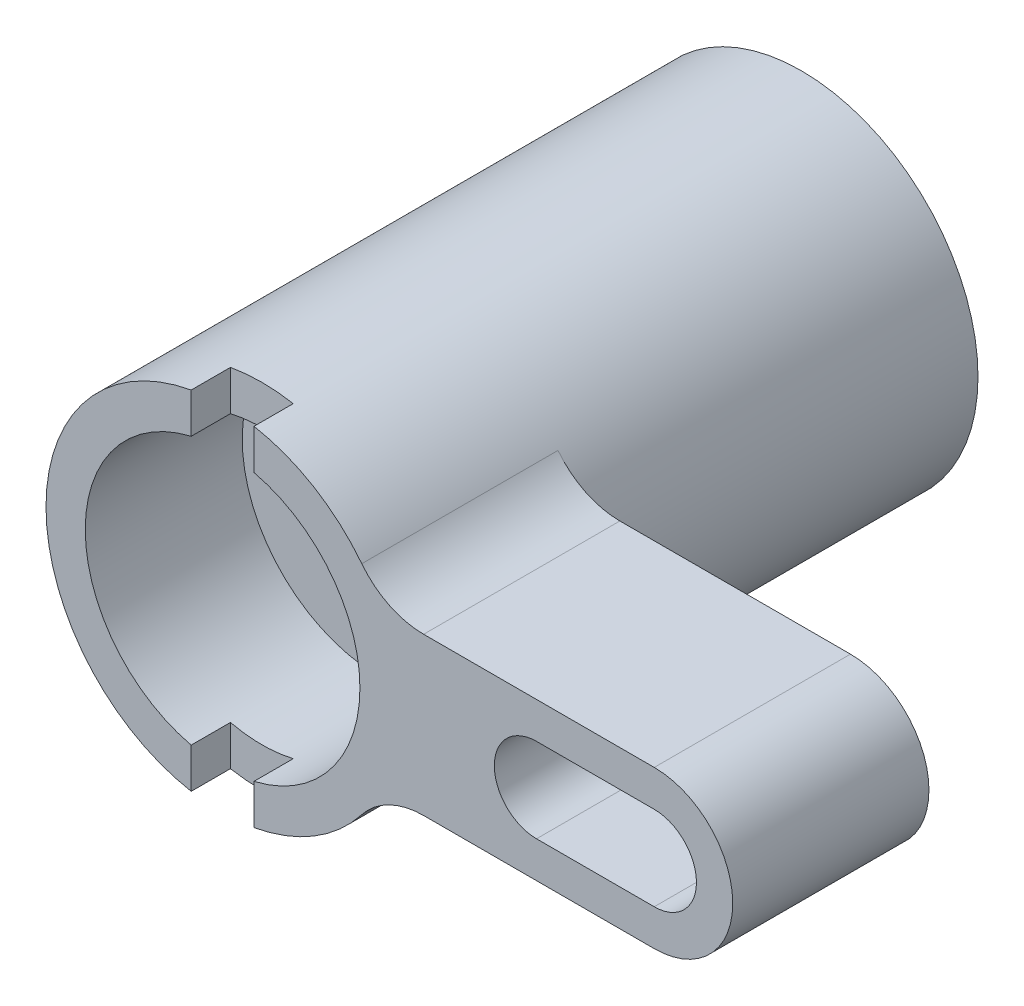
ISO-10303-21;
HEADER;
FILE_DESCRIPTION(('STEP AP214'),'2;1');
FILE_NAME('part.step','',(''),(''),'','','');
FILE_SCHEMA(('AUTOMOTIVE_DESIGN { 1 0 10303 214 1 1 1 1 }'));
ENDSEC;
DATA;
#1=APPLICATION_CONTEXT('core data for automotive mechanical design processes');
#2=APPLICATION_PROTOCOL_DEFINITION('international standard','automotive_design',2000,#1);
#3=PRODUCT_CONTEXT('',#1,'mechanical');
#4=PRODUCT('Part','Part','',(#3));
#5=PRODUCT_RELATED_PRODUCT_CATEGORY('part','',(#4));
#6=PRODUCT_DEFINITION_FORMATION('','',#4);
#7=PRODUCT_DEFINITION_CONTEXT('part definition',#1,'design');
#8=PRODUCT_DEFINITION('design','',#6,#7);
#9=PRODUCT_DEFINITION_SHAPE('','',#8);
#10=(LENGTH_UNIT() NAMED_UNIT(*) SI_UNIT(.MILLI.,.METRE.));
#11=(NAMED_UNIT(*) PLANE_ANGLE_UNIT() SI_UNIT($,.RADIAN.));
#12=(NAMED_UNIT(*) SI_UNIT($,.STERADIAN.) SOLID_ANGLE_UNIT());
#13=UNCERTAINTY_MEASURE_WITH_UNIT(LENGTH_MEASURE(1.E-05),#10,'distance_accuracy_value','');
#14=(GEOMETRIC_REPRESENTATION_CONTEXT(3) GLOBAL_UNCERTAINTY_ASSIGNED_CONTEXT((#13)) GLOBAL_UNIT_ASSIGNED_CONTEXT((#10,
#11,#12)) REPRESENTATION_CONTEXT('',''));
#15=CARTESIAN_POINT('',(0.,0.,0.));
#16=DIRECTION('',(0.,0.,1.));
#17=DIRECTION('',(1.,0.,0.));
#18=AXIS2_PLACEMENT_3D('',#15,#16,#17);
#19=CARTESIAN_POINT('',(0.,0.,29.5));
#20=DIRECTION('',(0.,0.,1.));
#21=DIRECTION('',(0.,1.,0.));
#22=AXIS2_PLACEMENT_3D('',#19,#20,#21);
#23=PLANE('',#22);
#24=CARTESIAN_POINT('',(22.,0.,29.5));
#25=DIRECTION('',(0.,0.,1.));
#26=DIRECTION('',(0.,1.,0.));
#27=AXIS2_PLACEMENT_3D('',#24,#25,#26);
#28=CIRCLE('',#27,2.15);
#29=CARTESIAN_POINT('',(22.,-2.15,29.5));
#30=VERTEX_POINT('',#29);
#31=CARTESIAN_POINT('',(22.,2.15,29.5));
#32=VERTEX_POINT('',#31);
#33=EDGE_CURVE('E176',#30,#32,#28,.T.);
#34=ORIENTED_EDGE('',*,*,#33,.F.);
#35=DIRECTION('',(1.,0.,0.));
#36=VECTOR('',#35,1.);
#37=CARTESIAN_POINT('',(22.,-2.15,29.5));
#38=LINE('',#37,#36);
#39=CARTESIAN_POINT('',(16.,-2.15,29.5));
#40=VERTEX_POINT('',#39);
#41=EDGE_CURVE('E184',#40,#30,#38,.T.);
#42=ORIENTED_EDGE('',*,*,#41,.F.);
#43=CARTESIAN_POINT('',(16.,0.,29.5));
#44=DIRECTION('',(0.,0.,1.));
#45=DIRECTION('',(0.,1.,0.));
#46=AXIS2_PLACEMENT_3D('',#43,#44,#45);
#47=CIRCLE('',#46,2.15);
#48=CARTESIAN_POINT('',(16.,2.15,29.5));
#49=VERTEX_POINT('',#48);
#50=EDGE_CURVE('E181',#49,#40,#47,.T.);
#51=ORIENTED_EDGE('',*,*,#50,.F.);
#52=DIRECTION('',(-1.,0.,0.));
#53=VECTOR('',#52,1.);
#54=CARTESIAN_POINT('',(22.,2.15,29.5));
#55=LINE('',#54,#53);
#56=EDGE_CURVE('E178',#32,#49,#55,.T.);
#57=ORIENTED_EDGE('',*,*,#56,.F.);
#58=EDGE_LOOP('',(#34,#42,#51,#57));
#59=FACE_BOUND('',#58,.T.);
#60=DIRECTION('',(0.,1.,0.));
#61=VECTOR('',#60,1.);
#62=CARTESIAN_POINT('',(1.6,-9.5,29.5));
#63=LINE('',#62,#61);
#64=CARTESIAN_POINT('',(1.6,6.81469001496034,29.5));
#65=VERTEX_POINT('',#64);
#66=CARTESIAN_POINT('',(1.6,8.85663593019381,29.5));
#67=VERTEX_POINT('',#66);
#68=EDGE_CURVE('E245',#65,#67,#63,.T.);
#69=ORIENTED_EDGE('',*,*,#68,.F.);
#70=CARTESIAN_POINT('',(0.,0.,29.5));
#71=DIRECTION('',(0.,0.,1.));
#72=DIRECTION('',(0.,1.,0.));
#73=AXIS2_PLACEMENT_3D('',#70,#71,#72);
#74=CIRCLE('',#73,7.);
#75=CARTESIAN_POINT('',(1.6,-6.81469001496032,29.5));
#76=VERTEX_POINT('',#75);
#77=EDGE_CURVE('E260',#65,#76,#74,.F.);
#78=ORIENTED_EDGE('',*,*,#77,.T.);
#79=CARTESIAN_POINT('',(1.6,-8.85663593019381,29.5));
#80=VERTEX_POINT('',#79);
#81=EDGE_CURVE('E152',#80,#76,#63,.T.);
#82=ORIENTED_EDGE('',*,*,#81,.F.);
#83=CARTESIAN_POINT('',(0.,0.,29.5));
#84=DIRECTION('',(0.,0.,1.));
#85=DIRECTION('',(0.,1.,0.));
#86=AXIS2_PLACEMENT_3D('',#83,#84,#85);
#87=CIRCLE('',#86,9.);
#88=CARTESIAN_POINT('',(7.09404283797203,-5.53846153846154,29.5));
#89=VERTEX_POINT('',#88);
#90=EDGE_CURVE('E320',#80,#89,#87,.T.);
#91=ORIENTED_EDGE('',*,*,#90,.T.);
#92=CARTESIAN_POINT('',(10.2469507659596,-8.,29.5));
#93=DIRECTION('',(0.,0.,1.));
#94=DIRECTION('',(0.,1.,0.));
#95=AXIS2_PLACEMENT_3D('',#92,#93,#94);
#96=CIRCLE('',#95,4.);
#97=CARTESIAN_POINT('',(10.2469507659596,-4.,29.5));
#98=VERTEX_POINT('',#97);
#99=EDGE_CURVE('E235',#89,#98,#96,.F.);
#100=ORIENTED_EDGE('',*,*,#99,.T.);
#101=DIRECTION('',(1.,0.,0.));
#102=VECTOR('',#101,1.);
#103=CARTESIAN_POINT('',(22.,-4.,29.5));
#104=LINE('',#103,#102);
#105=CARTESIAN_POINT('',(22.,-4.,29.5));
#106=VERTEX_POINT('',#105);
#107=EDGE_CURVE('E317',#98,#106,#104,.T.);
#108=ORIENTED_EDGE('',*,*,#107,.T.);
#109=CARTESIAN_POINT('',(22.,0.,29.5));
#110=DIRECTION('',(0.,0.,1.));
#111=DIRECTION('',(0.,1.,0.));
#112=AXIS2_PLACEMENT_3D('',#109,#110,#111);
#113=CIRCLE('',#112,4.);
#114=CARTESIAN_POINT('',(22.,4.,29.5));
#115=VERTEX_POINT('',#114);
#116=EDGE_CURVE('E220',#106,#115,#113,.T.);
#117=ORIENTED_EDGE('',*,*,#116,.T.);
#118=DIRECTION('',(-1.,0.,0.));
#119=VECTOR('',#118,1.);
#120=CARTESIAN_POINT('',(22.,4.,29.5));
#121=LINE('',#120,#119);
#122=CARTESIAN_POINT('',(10.2469507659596,4.,29.5));
#123=VERTEX_POINT('',#122);
#124=EDGE_CURVE('E341',#115,#123,#121,.T.);
#125=ORIENTED_EDGE('',*,*,#124,.T.);
#126=CARTESIAN_POINT('',(10.2469507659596,8.,29.5));
#127=DIRECTION('',(0.,0.,1.));
#128=DIRECTION('',(0.,1.,0.));
#129=AXIS2_PLACEMENT_3D('',#126,#127,#128);
#130=CIRCLE('',#129,4.);
#131=CARTESIAN_POINT('',(7.09404283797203,5.53846153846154,29.5));
#132=VERTEX_POINT('',#131);
#133=EDGE_CURVE('E22',#123,#132,#130,.F.);
#134=ORIENTED_EDGE('',*,*,#133,.T.);
#135=EDGE_CURVE('E312',#132,#67,#87,.T.);
#136=ORIENTED_EDGE('',*,*,#135,.T.);
#137=EDGE_LOOP('',(#69,#78,#82,#91,#100,#108,#117,#125,#134,#136));
#138=FACE_BOUND('',#137,.T.);
#139=ADVANCED_FACE('F14',(#59,#138),#23,.T.);
#140=DIRECTION('',(0.,-1.,0.));
#141=VECTOR('',#140,1.);
#142=CARTESIAN_POINT('',(-1.6,-9.5,29.5));
#143=LINE('',#142,#141);
#144=CARTESIAN_POINT('',(-1.6,-6.81469001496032,29.5));
#145=VERTEX_POINT('',#144);
#146=CARTESIAN_POINT('',(-1.6,-8.85663593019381,29.5));
#147=VERTEX_POINT('',#146);
#148=EDGE_CURVE('E165',#145,#147,#143,.T.);
#149=ORIENTED_EDGE('',*,*,#148,.F.);
#150=CARTESIAN_POINT('',(0.,0.,29.5));
#151=DIRECTION('',(0.,0.,1.));
#152=DIRECTION('',(0.,1.,0.));
#153=AXIS2_PLACEMENT_3D('',#150,#151,#152);
#154=CIRCLE('',#153,7.);
#155=CARTESIAN_POINT('',(-1.6,6.81469001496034,29.5));
#156=VERTEX_POINT('',#155);
#157=EDGE_CURVE('E153',#145,#156,#154,.F.);
#158=ORIENTED_EDGE('',*,*,#157,.T.);
#159=CARTESIAN_POINT('',(-1.6,8.85663593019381,29.5));
#160=VERTEX_POINT('',#159);
#161=EDGE_CURVE('E163',#160,#156,#143,.T.);
#162=ORIENTED_EDGE('',*,*,#161,.F.);
#163=EDGE_CURVE('E318',#160,#147,#87,.T.);
#164=ORIENTED_EDGE('',*,*,#163,.T.);
#165=EDGE_LOOP('',(#149,#158,#162,#164));
#166=FACE_BOUND('',#165,.T.);
#167=ADVANCED_FACE('F299',(#166),#23,.T.);
#168=CARTESIAN_POINT('',(1.6,9.5,27.5));
#169=DIRECTION('',(0.,0.,1.));
#170=DIRECTION('',(0.,1.,0.));
#171=AXIS2_PLACEMENT_3D('',#168,#169,#170);
#172=PLANE('',#171);
#173=DIRECTION('',(0.,-1.,0.));
#174=VECTOR('',#173,1.);
#175=CARTESIAN_POINT('',(-1.6,-9.5,27.5));
#176=LINE('',#175,#174);
#177=CARTESIAN_POINT('',(-1.6,8.85663593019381,27.5));
#178=VERTEX_POINT('',#177);
#179=CARTESIAN_POINT('',(-1.6,6.81469001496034,27.5));
#180=VERTEX_POINT('',#179);
#181=EDGE_CURVE('E161',#178,#180,#176,.T.);
#182=ORIENTED_EDGE('',*,*,#181,.T.);
#183=CARTESIAN_POINT('',(0.,0.,27.5));
#184=DIRECTION('',(0.,0.,1.));
#185=DIRECTION('',(0.,1.,0.));
#186=AXIS2_PLACEMENT_3D('',#183,#184,#185);
#187=CIRCLE('',#186,7.);
#188=CARTESIAN_POINT('',(1.6,6.81469001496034,27.5));
#189=VERTEX_POINT('',#188);
#190=EDGE_CURVE('E243',#180,#189,#187,.F.);
#191=ORIENTED_EDGE('',*,*,#190,.T.);
#192=DIRECTION('',(0.,1.,0.));
#193=VECTOR('',#192,1.);
#194=CARTESIAN_POINT('',(1.6,-9.5,27.5));
#195=LINE('',#194,#193);
#196=CARTESIAN_POINT('',(1.6,8.85663593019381,27.5));
#197=VERTEX_POINT('',#196);
#198=EDGE_CURVE('E159',#189,#197,#195,.T.);
#199=ORIENTED_EDGE('',*,*,#198,.T.);
#200=CARTESIAN_POINT('',(0.,0.,27.5));
#201=DIRECTION('',(0.,0.,1.));
#202=DIRECTION('',(0.,1.,0.));
#203=AXIS2_PLACEMENT_3D('',#200,#201,#202);
#204=CIRCLE('',#203,9.);
#205=EDGE_CURVE('E326',#197,#178,#204,.T.);
#206=ORIENTED_EDGE('',*,*,#205,.T.);
#207=EDGE_LOOP('',(#182,#191,#199,#206));
#208=FACE_BOUND('',#207,.T.);
#209=ADVANCED_FACE('F305',(#208),#172,.T.);
#210=CARTESIAN_POINT('',(-1.6,-9.5,27.5));
#211=DIRECTION('',(-1.,0.,0.));
#212=DIRECTION('',(0.,-1.,0.));
#213=AXIS2_PLACEMENT_3D('',#210,#211,#212);
#214=PLANE('',#213);
#215=DIRECTION('',(0.,0.,-1.));
#216=VECTOR('',#215,1.);
#217=CARTESIAN_POINT('',(-1.6,6.81469001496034,31.5));
#218=LINE('',#217,#216);
#219=EDGE_CURVE('E256',#180,#156,#218,.F.);
#220=ORIENTED_EDGE('',*,*,#219,.F.);
#221=ORIENTED_EDGE('',*,*,#181,.F.);
#222=DIRECTION('',(0.,0.,-1.));
#223=VECTOR('',#222,1.);
#224=CARTESIAN_POINT('',(-1.6,8.85663593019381,29.5));
#225=LINE('',#224,#223);
#226=EDGE_CURVE('E328',#160,#178,#225,.T.);
#227=ORIENTED_EDGE('',*,*,#226,.F.);
#228=ORIENTED_EDGE('',*,*,#161,.T.);
#229=EDGE_LOOP('',(#220,#221,#227,#228));
#230=FACE_BOUND('',#229,.T.);
#231=ADVANCED_FACE('F378',(#230),#214,.F.);
#232=CARTESIAN_POINT('',(1.6,-9.5,27.5));
#233=DIRECTION('',(1.,0.,0.));
#234=DIRECTION('',(0.,1.,0.));
#235=AXIS2_PLACEMENT_3D('',#232,#233,#234);
#236=PLANE('',#235);
#237=DIRECTION('',(0.,0.,-1.));
#238=VECTOR('',#237,1.);
#239=CARTESIAN_POINT('',(1.6,6.81469001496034,31.5));
#240=LINE('',#239,#238);
#241=EDGE_CURVE('E258',#65,#189,#240,.T.);
#242=ORIENTED_EDGE('',*,*,#241,.F.);
#243=ORIENTED_EDGE('',*,*,#68,.T.);
#244=DIRECTION('',(0.,0.,-1.));
#245=VECTOR('',#244,1.);
#246=CARTESIAN_POINT('',(1.6,8.85663593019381,29.5));
#247=LINE('',#246,#245);
#248=EDGE_CURVE('E322',#197,#67,#247,.F.);
#249=ORIENTED_EDGE('',*,*,#248,.F.);
#250=ORIENTED_EDGE('',*,*,#198,.F.);
#251=EDGE_LOOP('',(#242,#243,#249,#250));
#252=FACE_BOUND('',#251,.T.);
#253=ADVANCED_FACE('F382',(#252),#236,.F.);
#254=DIRECTION('',(0.,0.,-1.));
#255=VECTOR('',#254,1.);
#256=CARTESIAN_POINT('',(1.6,-6.81469001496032,31.5));
#257=LINE('',#256,#255);
#258=CARTESIAN_POINT('',(1.6,-6.81469001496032,27.5));
#259=VERTEX_POINT('',#258);
#260=EDGE_CURVE('E140',#259,#76,#257,.F.);
#261=ORIENTED_EDGE('',*,*,#260,.F.);
#262=CARTESIAN_POINT('',(1.6,-8.85663593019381,27.5));
#263=VERTEX_POINT('',#262);
#264=EDGE_CURVE('E149',#263,#259,#195,.T.);
#265=ORIENTED_EDGE('',*,*,#264,.F.);
#266=DIRECTION('',(0.,0.,-1.));
#267=VECTOR('',#266,1.);
#268=CARTESIAN_POINT('',(1.6,-8.85663593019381,29.5));
#269=LINE('',#268,#267);
#270=EDGE_CURVE('E221',#80,#263,#269,.T.);
#271=ORIENTED_EDGE('',*,*,#270,.F.);
#272=ORIENTED_EDGE('',*,*,#81,.T.);
#273=EDGE_LOOP('',(#261,#265,#271,#272));
#274=FACE_BOUND('',#273,.T.);
#275=ADVANCED_FACE('F148',(#274),#236,.F.);
#276=DIRECTION('',(0.,0.,-1.));
#277=VECTOR('',#276,1.);
#278=CARTESIAN_POINT('',(-1.6,-6.81469001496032,31.5));
#279=LINE('',#278,#277);
#280=CARTESIAN_POINT('',(-1.6,-6.81469001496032,27.5));
#281=VERTEX_POINT('',#280);
#282=EDGE_CURVE('E30',#145,#281,#279,.T.);
#283=ORIENTED_EDGE('',*,*,#282,.F.);
#284=ORIENTED_EDGE('',*,*,#148,.T.);
#285=DIRECTION('',(0.,0.,-1.));
#286=VECTOR('',#285,1.);
#287=CARTESIAN_POINT('',(-1.6,-8.85663593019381,29.5));
#288=LINE('',#287,#286);
#289=CARTESIAN_POINT('',(-1.6,-8.85663593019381,27.5));
#290=VERTEX_POINT('',#289);
#291=EDGE_CURVE('E330',#290,#147,#288,.F.);
#292=ORIENTED_EDGE('',*,*,#291,.F.);
#293=EDGE_CURVE('E158',#281,#290,#176,.T.);
#294=ORIENTED_EDGE('',*,*,#293,.F.);
#295=EDGE_LOOP('',(#283,#284,#292,#294));
#296=FACE_BOUND('',#295,.T.);
#297=ADVANCED_FACE('F384',(#296),#214,.F.);
#298=ORIENTED_EDGE('',*,*,#264,.T.);
#299=CARTESIAN_POINT('',(0.,0.,27.5));
#300=DIRECTION('',(0.,0.,1.));
#301=DIRECTION('',(0.,1.,0.));
#302=AXIS2_PLACEMENT_3D('',#299,#300,#301);
#303=CIRCLE('',#302,7.);
#304=EDGE_CURVE('E9',#259,#281,#303,.F.);
#305=ORIENTED_EDGE('',*,*,#304,.T.);
#306=ORIENTED_EDGE('',*,*,#293,.T.);
#307=EDGE_CURVE('E157',#290,#263,#204,.T.);
#308=ORIENTED_EDGE('',*,*,#307,.T.);
#309=EDGE_LOOP('',(#298,#305,#306,#308));
#310=FACE_BOUND('',#309,.T.);
#311=ADVANCED_FACE('F155',(#310),#172,.T.);
#312=CARTESIAN_POINT('',(0.,0.,19.5));
#313=DIRECTION('',(0.,0.,1.));
#314=DIRECTION('',(0.,1.,0.));
#315=AXIS2_PLACEMENT_3D('',#312,#313,#314);
#316=PLANE('',#315);
#317=DIRECTION('',(-1.,0.,0.));
#318=VECTOR('',#317,1.);
#319=CARTESIAN_POINT('',(22.,-2.15,19.5));
#320=LINE('',#319,#318);
#321=CARTESIAN_POINT('',(22.,-2.15,19.5));
#322=VERTEX_POINT('',#321);
#323=CARTESIAN_POINT('',(16.,-2.15,19.5));
#324=VERTEX_POINT('',#323);
#325=EDGE_CURVE('E170',#322,#324,#320,.T.);
#326=ORIENTED_EDGE('',*,*,#325,.F.);
#327=CARTESIAN_POINT('',(22.,0.,19.5));
#328=DIRECTION('',(0.,0.,1.));
#329=DIRECTION('',(0.,1.,0.));
#330=AXIS2_PLACEMENT_3D('',#327,#328,#329);
#331=CIRCLE('',#330,2.15);
#332=CARTESIAN_POINT('',(22.,2.15,19.5));
#333=VERTEX_POINT('',#332);
#334=EDGE_CURVE('E173',#333,#322,#331,.F.);
#335=ORIENTED_EDGE('',*,*,#334,.F.);
#336=DIRECTION('',(1.,0.,0.));
#337=VECTOR('',#336,1.);
#338=CARTESIAN_POINT('',(22.,2.15,19.5));
#339=LINE('',#338,#337);
#340=CARTESIAN_POINT('',(16.,2.15,19.5));
#341=VERTEX_POINT('',#340);
#342=EDGE_CURVE('E190',#341,#333,#339,.T.);
#343=ORIENTED_EDGE('',*,*,#342,.F.);
#344=CARTESIAN_POINT('',(16.,0.,19.5));
#345=DIRECTION('',(0.,0.,1.));
#346=DIRECTION('',(0.,1.,0.));
#347=AXIS2_PLACEMENT_3D('',#344,#345,#346);
#348=CIRCLE('',#347,2.15);
#349=EDGE_CURVE('E168',#324,#341,#348,.F.);
#350=ORIENTED_EDGE('',*,*,#349,.F.);
#351=EDGE_LOOP('',(#326,#335,#343,#350));
#352=FACE_BOUND('',#351,.T.);
#353=DIRECTION('',(1.,0.,0.));
#354=VECTOR('',#353,1.);
#355=CARTESIAN_POINT('',(22.,-4.,19.5));
#356=LINE('',#355,#354);
#357=CARTESIAN_POINT('',(10.2469507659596,-4.,19.5));
#358=VERTEX_POINT('',#357);
#359=CARTESIAN_POINT('',(22.,-4.,19.5));
#360=VERTEX_POINT('',#359);
#361=EDGE_CURVE('E217',#358,#360,#356,.T.);
#362=ORIENTED_EDGE('',*,*,#361,.F.);
#363=CARTESIAN_POINT('',(10.2469507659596,-8.,19.5));
#364=DIRECTION('',(0.,0.,1.));
#365=DIRECTION('',(0.,1.,0.));
#366=AXIS2_PLACEMENT_3D('',#363,#364,#365);
#367=CIRCLE('',#366,4.);
#368=CARTESIAN_POINT('',(7.09404283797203,-5.53846153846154,19.5));
#369=VERTEX_POINT('',#368);
#370=EDGE_CURVE('E232',#358,#369,#367,.T.);
#371=ORIENTED_EDGE('',*,*,#370,.T.);
#372=CARTESIAN_POINT('',(0.,0.,19.5));
#373=DIRECTION('',(0.,0.,1.));
#374=DIRECTION('',(0.,1.,0.));
#375=AXIS2_PLACEMENT_3D('',#372,#373,#374);
#376=CIRCLE('',#375,9.);
#377=CARTESIAN_POINT('',(7.09404283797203,5.53846153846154,19.5));
#378=VERTEX_POINT('',#377);
#379=EDGE_CURVE('E199',#369,#378,#376,.T.);
#380=ORIENTED_EDGE('',*,*,#379,.T.);
#381=CARTESIAN_POINT('',(10.2469507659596,8.,19.5));
#382=DIRECTION('',(0.,0.,1.));
#383=DIRECTION('',(0.,1.,0.));
#384=AXIS2_PLACEMENT_3D('',#381,#382,#383);
#385=CIRCLE('',#384,4.);
#386=CARTESIAN_POINT('',(10.2469507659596,4.,19.5));
#387=VERTEX_POINT('',#386);
#388=EDGE_CURVE('E237',#378,#387,#385,.T.);
#389=ORIENTED_EDGE('',*,*,#388,.T.);
#390=DIRECTION('',(-1.,0.,0.));
#391=VECTOR('',#390,1.);
#392=CARTESIAN_POINT('',(22.,4.,19.5));
#393=LINE('',#392,#391);
#394=CARTESIAN_POINT('',(22.,4.,19.5));
#395=VERTEX_POINT('',#394);
#396=EDGE_CURVE('E214',#395,#387,#393,.T.);
#397=ORIENTED_EDGE('',*,*,#396,.F.);
#398=CARTESIAN_POINT('',(22.,0.,19.5));
#399=DIRECTION('',(0.,0.,1.));
#400=DIRECTION('',(0.,1.,0.));
#401=AXIS2_PLACEMENT_3D('',#398,#399,#400);
#402=CIRCLE('',#401,4.);
#403=EDGE_CURVE('E203',#360,#395,#402,.T.);
#404=ORIENTED_EDGE('',*,*,#403,.F.);
#405=EDGE_LOOP('',(#362,#371,#380,#389,#397,#404));
#406=FACE_BOUND('',#405,.T.);
#407=ADVANCED_FACE('F353',(#352,#406),#316,.F.);
#408=CARTESIAN_POINT('',(22.,0.,29.5));
#409=DIRECTION('',(0.,0.,-1.));
#410=DIRECTION('',(0.,-1.,0.));
#411=AXIS2_PLACEMENT_3D('',#408,#409,#410);
#412=CYLINDRICAL_SURFACE('',#411,4.);
#413=ORIENTED_EDGE('',*,*,#403,.T.);
#414=DIRECTION('',(0.,0.,-1.));
#415=VECTOR('',#414,1.);
#416=CARTESIAN_POINT('',(22.,4.,29.5));
#417=LINE('',#416,#415);
#418=EDGE_CURVE('E359',#115,#395,#417,.T.);
#419=ORIENTED_EDGE('',*,*,#418,.F.);
#420=ORIENTED_EDGE('',*,*,#116,.F.);
#421=DIRECTION('',(0.,0.,-1.));
#422=VECTOR('',#421,1.);
#423=CARTESIAN_POINT('',(22.,-4.,29.5));
#424=LINE('',#423,#422);
#425=EDGE_CURVE('E449',#106,#360,#424,.T.);
#426=ORIENTED_EDGE('',*,*,#425,.T.);
#427=EDGE_LOOP('',(#413,#419,#420,#426));
#428=FACE_BOUND('',#427,.T.);
#429=ADVANCED_FACE('F414',(#428),#412,.T.);
#430=CARTESIAN_POINT('',(22.,4.,29.5));
#431=DIRECTION('',(0.,-1.,0.));
#432=DIRECTION('',(1.,0.,0.));
#433=AXIS2_PLACEMENT_3D('',#430,#431,#432);
#434=PLANE('',#433);
#435=ORIENTED_EDGE('',*,*,#396,.T.);
#436=DIRECTION('',(0.,0.,1.));
#437=VECTOR('',#436,1.);
#438=CARTESIAN_POINT('',(10.2469507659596,4.,29.5));
#439=LINE('',#438,#437);
#440=EDGE_CURVE('E37',#387,#123,#439,.T.);
#441=ORIENTED_EDGE('',*,*,#440,.T.);
#442=ORIENTED_EDGE('',*,*,#124,.F.);
#443=ORIENTED_EDGE('',*,*,#418,.T.);
#444=EDGE_LOOP('',(#435,#441,#442,#443));
#445=FACE_BOUND('',#444,.T.);
#446=ADVANCED_FACE('F358',(#445),#434,.F.);
#447=CARTESIAN_POINT('',(0.,0.,29.5));
#448=DIRECTION('',(0.,0.,-1.));
#449=DIRECTION('',(0.,-1.,0.));
#450=AXIS2_PLACEMENT_3D('',#447,#448,#449);
#451=CYLINDRICAL_SURFACE('',#450,9.);
#452=ORIENTED_EDGE('',*,*,#379,.F.);
#453=DIRECTION('',(0.,0.,-1.));
#454=VECTOR('',#453,1.);
#455=CARTESIAN_POINT('',(7.09404283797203,-5.53846153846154,29.5));
#456=LINE('',#455,#454);
#457=EDGE_CURVE('E229',#369,#89,#456,.F.);
#458=ORIENTED_EDGE('',*,*,#457,.T.);
#459=ORIENTED_EDGE('',*,*,#90,.F.);
#460=ORIENTED_EDGE('',*,*,#270,.T.);
#461=ORIENTED_EDGE('',*,*,#307,.F.);
#462=ORIENTED_EDGE('',*,*,#291,.T.);
#463=ORIENTED_EDGE('',*,*,#163,.F.);
#464=ORIENTED_EDGE('',*,*,#226,.T.);
#465=ORIENTED_EDGE('',*,*,#205,.F.);
#466=ORIENTED_EDGE('',*,*,#248,.T.);
#467=ORIENTED_EDGE('',*,*,#135,.F.);
#468=DIRECTION('',(0.,0.,-1.));
#469=VECTOR('',#468,1.);
#470=CARTESIAN_POINT('',(7.09404283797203,5.53846153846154,29.5));
#471=LINE('',#470,#469);
#472=EDGE_CURVE('E226',#132,#378,#471,.T.);
#473=ORIENTED_EDGE('',*,*,#472,.T.);
#474=EDGE_LOOP('',(#452,#458,#459,#460,#461,#462,#463,#464,#465,#466,#467,#473));
#475=FACE_BOUND('',#474,.T.);
#476=CARTESIAN_POINT('',(0.,0.,0.));
#477=DIRECTION('',(0.,0.,1.));
#478=DIRECTION('',(0.,1.,0.));
#479=AXIS2_PLACEMENT_3D('',#476,#477,#478);
#480=CIRCLE('',#479,9.);
#481=CARTESIAN_POINT('',(0.,9.,0.));
#482=VERTEX_POINT('',#481);
#483=EDGE_CURVE('E200',#482,#482,#480,.T.);
#484=ORIENTED_EDGE('',*,*,#483,.T.);
#485=EDGE_LOOP('',(#484));
#486=FACE_BOUND('',#485,.T.);
#487=ADVANCED_FACE('F323',(#475,#486),#451,.T.);
#488=CARTESIAN_POINT('',(22.,-4.,29.5));
#489=DIRECTION('',(0.,1.,0.));
#490=DIRECTION('',(-1.,0.,0.));
#491=AXIS2_PLACEMENT_3D('',#488,#489,#490);
#492=PLANE('',#491);
#493=ORIENTED_EDGE('',*,*,#107,.F.);
#494=DIRECTION('',(0.,0.,1.));
#495=VECTOR('',#494,1.);
#496=CARTESIAN_POINT('',(10.2469507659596,-4.,19.5));
#497=LINE('',#496,#495);
#498=EDGE_CURVE('E223',#98,#358,#497,.F.);
#499=ORIENTED_EDGE('',*,*,#498,.T.);
#500=ORIENTED_EDGE('',*,*,#361,.T.);
#501=ORIENTED_EDGE('',*,*,#425,.F.);
#502=EDGE_LOOP('',(#493,#499,#500,#501));
#503=FACE_BOUND('',#502,.T.);
#504=ADVANCED_FACE('F348',(#503),#492,.F.);
#505=CARTESIAN_POINT('',(0.,0.,0.));
#506=DIRECTION('',(0.,0.,1.));
#507=DIRECTION('',(0.,1.,0.));
#508=AXIS2_PLACEMENT_3D('',#505,#506,#507);
#509=PLANE('',#508);
#510=CARTESIAN_POINT('',(0.,0.,0.));
#511=DIRECTION('',(0.,0.,1.));
#512=DIRECTION('',(0.,1.,0.));
#513=AXIS2_PLACEMENT_3D('',#510,#511,#512);
#514=CIRCLE('',#513,6.);
#515=CARTESIAN_POINT('',(0.,6.,0.));
#516=VERTEX_POINT('',#515);
#517=EDGE_CURVE('E17',#516,#516,#514,.T.);
#518=ORIENTED_EDGE('',*,*,#517,.T.);
#519=EDGE_LOOP('',(#518));
#520=FACE_BOUND('',#519,.T.);
#521=ORIENTED_EDGE('',*,*,#483,.F.);
#522=EDGE_LOOP('',(#521));
#523=FACE_BOUND('',#522,.T.);
#524=ADVANCED_FACE('F278',(#520,#523),#509,.F.);
#525=CARTESIAN_POINT('',(22.,0.,-0.001000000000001));
#526=DIRECTION('',(0.,0.,1.));
#527=DIRECTION('',(0.,1.,0.));
#528=AXIS2_PLACEMENT_3D('',#525,#526,#527);
#529=CYLINDRICAL_SURFACE('',#528,2.15);
#530=ORIENTED_EDGE('',*,*,#334,.T.);
#531=DIRECTION('',(0.,0.,1.));
#532=VECTOR('',#531,1.);
#533=CARTESIAN_POINT('',(22.,-2.15,-0.001000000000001));
#534=LINE('',#533,#532);
#535=EDGE_CURVE('E188',#322,#30,#534,.T.);
#536=ORIENTED_EDGE('',*,*,#535,.T.);
#537=ORIENTED_EDGE('',*,*,#33,.T.);
#538=DIRECTION('',(0.,0.,1.));
#539=VECTOR('',#538,1.);
#540=CARTESIAN_POINT('',(22.,2.15,-0.001000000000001));
#541=LINE('',#540,#539);
#542=EDGE_CURVE('E187',#333,#32,#541,.T.);
#543=ORIENTED_EDGE('',*,*,#542,.F.);
#544=EDGE_LOOP('',(#530,#536,#537,#543));
#545=FACE_BOUND('',#544,.T.);
#546=ADVANCED_FACE('F391',(#545),#529,.F.);
#547=CARTESIAN_POINT('',(22.,-2.15,-0.001000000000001));
#548=DIRECTION('',(0.,-1.,0.));
#549=DIRECTION('',(1.,0.,0.));
#550=AXIS2_PLACEMENT_3D('',#547,#548,#549);
#551=PLANE('',#550);
#552=ORIENTED_EDGE('',*,*,#325,.T.);
#553=DIRECTION('',(0.,0.,1.));
#554=VECTOR('',#553,1.);
#555=CARTESIAN_POINT('',(16.,-2.15,-0.001000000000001));
#556=LINE('',#555,#554);
#557=EDGE_CURVE('E191',#324,#40,#556,.T.);
#558=ORIENTED_EDGE('',*,*,#557,.T.);
#559=ORIENTED_EDGE('',*,*,#41,.T.);
#560=ORIENTED_EDGE('',*,*,#535,.F.);
#561=EDGE_LOOP('',(#552,#558,#559,#560));
#562=FACE_BOUND('',#561,.T.);
#563=ADVANCED_FACE('F387',(#562),#551,.F.);
#564=CARTESIAN_POINT('',(16.,0.,-0.001000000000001));
#565=DIRECTION('',(0.,0.,1.));
#566=DIRECTION('',(0.,1.,0.));
#567=AXIS2_PLACEMENT_3D('',#564,#565,#566);
#568=CYLINDRICAL_SURFACE('',#567,2.15);
#569=ORIENTED_EDGE('',*,*,#349,.T.);
#570=DIRECTION('',(0.,0.,1.));
#571=VECTOR('',#570,1.);
#572=CARTESIAN_POINT('',(16.,2.15,-0.001000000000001));
#573=LINE('',#572,#571);
#574=EDGE_CURVE('E193',#341,#49,#573,.T.);
#575=ORIENTED_EDGE('',*,*,#574,.T.);
#576=ORIENTED_EDGE('',*,*,#50,.T.);
#577=ORIENTED_EDGE('',*,*,#557,.F.);
#578=EDGE_LOOP('',(#569,#575,#576,#577));
#579=FACE_BOUND('',#578,.T.);
#580=ADVANCED_FACE('F390',(#579),#568,.F.);
#581=CARTESIAN_POINT('',(22.,2.15,-0.001000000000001));
#582=DIRECTION('',(0.,1.,0.));
#583=DIRECTION('',(-1.,0.,0.));
#584=AXIS2_PLACEMENT_3D('',#581,#582,#583);
#585=PLANE('',#584);
#586=ORIENTED_EDGE('',*,*,#342,.T.);
#587=ORIENTED_EDGE('',*,*,#542,.T.);
#588=ORIENTED_EDGE('',*,*,#56,.T.);
#589=ORIENTED_EDGE('',*,*,#574,.F.);
#590=EDGE_LOOP('',(#586,#587,#588,#589));
#591=FACE_BOUND('',#590,.T.);
#592=ADVANCED_FACE('F372',(#591),#585,.F.);
#593=CARTESIAN_POINT('',(10.2469507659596,-8.,29.5));
#594=DIRECTION('',(0.,0.,-1.));
#595=DIRECTION('',(0.,-1.,0.));
#596=AXIS2_PLACEMENT_3D('',#593,#594,#595);
#597=CYLINDRICAL_SURFACE('',#596,4.);
#598=ORIENTED_EDGE('',*,*,#99,.F.);
#599=ORIENTED_EDGE('',*,*,#457,.F.);
#600=ORIENTED_EDGE('',*,*,#370,.F.);
#601=ORIENTED_EDGE('',*,*,#498,.F.);
#602=EDGE_LOOP('',(#598,#599,#600,#601));
#603=FACE_BOUND('',#602,.T.);
#604=ADVANCED_FACE('F345',(#603),#597,.F.);
#605=CARTESIAN_POINT('',(10.2469507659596,8.,29.5));
#606=DIRECTION('',(0.,0.,-1.));
#607=DIRECTION('',(0.,-1.,0.));
#608=AXIS2_PLACEMENT_3D('',#605,#606,#607);
#609=CYLINDRICAL_SURFACE('',#608,4.);
#610=ORIENTED_EDGE('',*,*,#133,.F.);
#611=ORIENTED_EDGE('',*,*,#440,.F.);
#612=ORIENTED_EDGE('',*,*,#388,.F.);
#613=ORIENTED_EDGE('',*,*,#472,.F.);
#614=EDGE_LOOP('',(#610,#611,#612,#613));
#615=FACE_BOUND('',#614,.T.);
#616=ADVANCED_FACE('F362',(#615),#609,.F.);
#617=CARTESIAN_POINT('',(0.,0.,31.5));
#618=DIRECTION('',(0.,0.,-1.));
#619=DIRECTION('',(-0.76604444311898,-0.642787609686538,0.));
#620=AXIS2_PLACEMENT_3D('',#617,#618,#619);
#621=CYLINDRICAL_SURFACE('',#620,7.);
#622=ORIENTED_EDGE('',*,*,#219,.T.);
#623=ORIENTED_EDGE('',*,*,#157,.F.);
#624=ORIENTED_EDGE('',*,*,#282,.T.);
#625=ORIENTED_EDGE('',*,*,#304,.F.);
#626=ORIENTED_EDGE('',*,*,#260,.T.);
#627=ORIENTED_EDGE('',*,*,#77,.F.);
#628=ORIENTED_EDGE('',*,*,#241,.T.);
#629=ORIENTED_EDGE('',*,*,#190,.F.);
#630=EDGE_LOOP('',(#622,#623,#624,#625,#626,#627,#628,#629));
#631=FACE_BOUND('',#630,.T.);
#632=CARTESIAN_POINT('',(0.,0.,21.5));
#633=DIRECTION('',(0.,0.,1.));
#634=DIRECTION('',(0.76604444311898,0.642787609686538,0.));
#635=AXIS2_PLACEMENT_3D('',#632,#633,#634);
#636=CIRCLE('',#635,7.);
#637=CARTESIAN_POINT('',(5.36231110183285,4.49951326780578,21.5));
#638=VERTEX_POINT('',#637);
#639=EDGE_CURVE('E265',#638,#638,#636,.T.);
#640=ORIENTED_EDGE('',*,*,#639,.F.);
#641=EDGE_LOOP('',(#640));
#642=FACE_BOUND('',#641,.T.);
#643=ADVANCED_FACE('F138',(#631,#642),#621,.F.);
#644=CARTESIAN_POINT('',(0.,0.,21.5));
#645=DIRECTION('',(0.,0.,1.));
#646=DIRECTION('',(0.76604444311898,0.642787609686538,0.));
#647=AXIS2_PLACEMENT_3D('',#644,#645,#646);
#648=PLANE('',#647);
#649=CARTESIAN_POINT('',(0.,0.,21.5));
#650=DIRECTION('',(0.,0.,1.));
#651=DIRECTION('',(0.,1.,0.));
#652=AXIS2_PLACEMENT_3D('',#649,#650,#651);
#653=CIRCLE('',#652,2.75);
#654=CARTESIAN_POINT('',(0.,2.75,21.5));
#655=VERTEX_POINT('',#654);
#656=EDGE_CURVE('E242',#655,#655,#653,.T.);
#657=ORIENTED_EDGE('',*,*,#656,.F.);
#658=EDGE_LOOP('',(#657));
#659=FACE_BOUND('',#658,.T.);
#660=ORIENTED_EDGE('',*,*,#639,.T.);
#661=EDGE_LOOP('',(#660));
#662=FACE_BOUND('',#661,.T.);
#663=ADVANCED_FACE('F370',(#659,#662),#648,.T.);
#664=CARTESIAN_POINT('',(0.,0.,19.5));
#665=DIRECTION('',(0.,0.,-1.));
#666=DIRECTION('',(0.,-1.,0.));
#667=AXIS2_PLACEMENT_3D('',#664,#665,#666);
#668=PLANE('',#667);
#669=CARTESIAN_POINT('',(0.,0.,19.5));
#670=DIRECTION('',(0.,0.,-1.));
#671=DIRECTION('',(0.,-1.,0.));
#672=AXIS2_PLACEMENT_3D('',#669,#670,#671);
#673=CIRCLE('',#672,2.5);
#674=CARTESIAN_POINT('',(0.,-2.49999999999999,19.5));
#675=VERTEX_POINT('',#674);
#676=EDGE_CURVE('E240',#675,#675,#673,.T.);
#677=ORIENTED_EDGE('',*,*,#676,.T.);
#678=EDGE_LOOP('',(#677));
#679=FACE_BOUND('',#678,.T.);
#680=CARTESIAN_POINT('',(0.,0.,19.5));
#681=DIRECTION('',(0.,0.,1.));
#682=DIRECTION('',(0.,1.,0.));
#683=AXIS2_PLACEMENT_3D('',#680,#681,#682);
#684=CIRCLE('',#683,2.75);
#685=CARTESIAN_POINT('',(0.,2.75,19.5));
#686=VERTEX_POINT('',#685);
#687=EDGE_CURVE('E210',#686,#686,#684,.T.);
#688=ORIENTED_EDGE('',*,*,#687,.T.);
#689=EDGE_LOOP('',(#688));
#690=FACE_BOUND('',#689,.T.);
#691=ADVANCED_FACE('F402',(#679,#690),#668,.F.);
#692=CARTESIAN_POINT('',(0.,0.,29.5));
#693=DIRECTION('',(0.,0.,-1.));
#694=DIRECTION('',(0.,-1.,0.));
#695=AXIS2_PLACEMENT_3D('',#692,#693,#694);
#696=CYLINDRICAL_SURFACE('',#695,2.75);
#697=ORIENTED_EDGE('',*,*,#687,.F.);
#698=EDGE_LOOP('',(#697));
#699=FACE_BOUND('',#698,.T.);
#700=ORIENTED_EDGE('',*,*,#656,.T.);
#701=EDGE_LOOP('',(#700));
#702=FACE_BOUND('',#701,.T.);
#703=ADVANCED_FACE('F295',(#699,#702),#696,.F.);
#704=CARTESIAN_POINT('',(0.,0.,13.7359808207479));
#705=DIRECTION('',(0.,0.,-1.));
#706=DIRECTION('',(-0.76604444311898,-0.642787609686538,0.));
#707=AXIS2_PLACEMENT_3D('',#704,#705,#706);
#708=CYLINDRICAL_SURFACE('',#707,2.5);
#709=CARTESIAN_POINT('',(0.,0.,18.));
#710=DIRECTION('',(0.,0.,1.));
#711=DIRECTION('',(0.,1.,0.));
#712=AXIS2_PLACEMENT_3D('',#709,#710,#711);
#713=CIRCLE('',#712,2.5);
#714=CARTESIAN_POINT('',(0.,2.50000000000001,18.));
#715=VERTEX_POINT('',#714);
#716=EDGE_CURVE('E268',#715,#715,#713,.T.);
#717=ORIENTED_EDGE('',*,*,#716,.F.);
#718=EDGE_LOOP('',(#717));
#719=FACE_BOUND('',#718,.T.);
#720=ORIENTED_EDGE('',*,*,#676,.F.);
#721=EDGE_LOOP('',(#720));
#722=FACE_BOUND('',#721,.T.);
#723=ADVANCED_FACE('F284',(#719,#722),#708,.F.);
#724=CARTESIAN_POINT('',(0.,0.,-10.5));
#725=DIRECTION('',(0.,0.,-1.));
#726=DIRECTION('',(0.,-1.,0.));
#727=AXIS2_PLACEMENT_3D('',#724,#725,#726);
#728=CYLINDRICAL_SURFACE('',#727,6.);
#729=CARTESIAN_POINT('',(0.,0.,18.));
#730=DIRECTION('',(0.,0.,-1.));
#731=DIRECTION('',(0.,-1.,0.));
#732=AXIS2_PLACEMENT_3D('',#729,#730,#731);
#733=CIRCLE('',#732,6.);
#734=CARTESIAN_POINT('',(0.,-6.,18.));
#735=VERTEX_POINT('',#734);
#736=EDGE_CURVE('E271',#735,#735,#733,.T.);
#737=ORIENTED_EDGE('',*,*,#736,.F.);
#738=EDGE_LOOP('',(#737));
#739=FACE_BOUND('',#738,.T.);
#740=ORIENTED_EDGE('',*,*,#517,.F.);
#741=EDGE_LOOP('',(#740));
#742=FACE_BOUND('',#741,.T.);
#743=ADVANCED_FACE('F281',(#739,#742),#728,.F.);
#744=CARTESIAN_POINT('',(-6.,0.,18.));
#745=DIRECTION('',(0.,0.,1.));
#746=DIRECTION('',(0.,1.,0.));
#747=AXIS2_PLACEMENT_3D('',#744,#745,#746);
#748=PLANE('',#747);
#749=ORIENTED_EDGE('',*,*,#716,.T.);
#750=EDGE_LOOP('',(#749));
#751=FACE_BOUND('',#750,.T.);
#752=ORIENTED_EDGE('',*,*,#736,.T.);
#753=EDGE_LOOP('',(#752));
#754=FACE_BOUND('',#753,.T.);
#755=ADVANCED_FACE('F283',(#751,#754),#748,.F.);
#756=CLOSED_SHELL('',(#139,#167,#209,#231,#253,#275,#297,#311,#407,#429,#446,#487,#504,#524,
#546,#563,#580,#592,#604,#616,#643,#663,#691,#703,#723,#743,#755));
#757=MANIFOLD_SOLID_BREP('B1',#756);
#758=ADVANCED_BREP_SHAPE_REPRESENTATION('',(#18,#757),#14);
#759=SHAPE_DEFINITION_REPRESENTATION(#9,#758);
ENDSEC;
END-ISO-10303-21;
